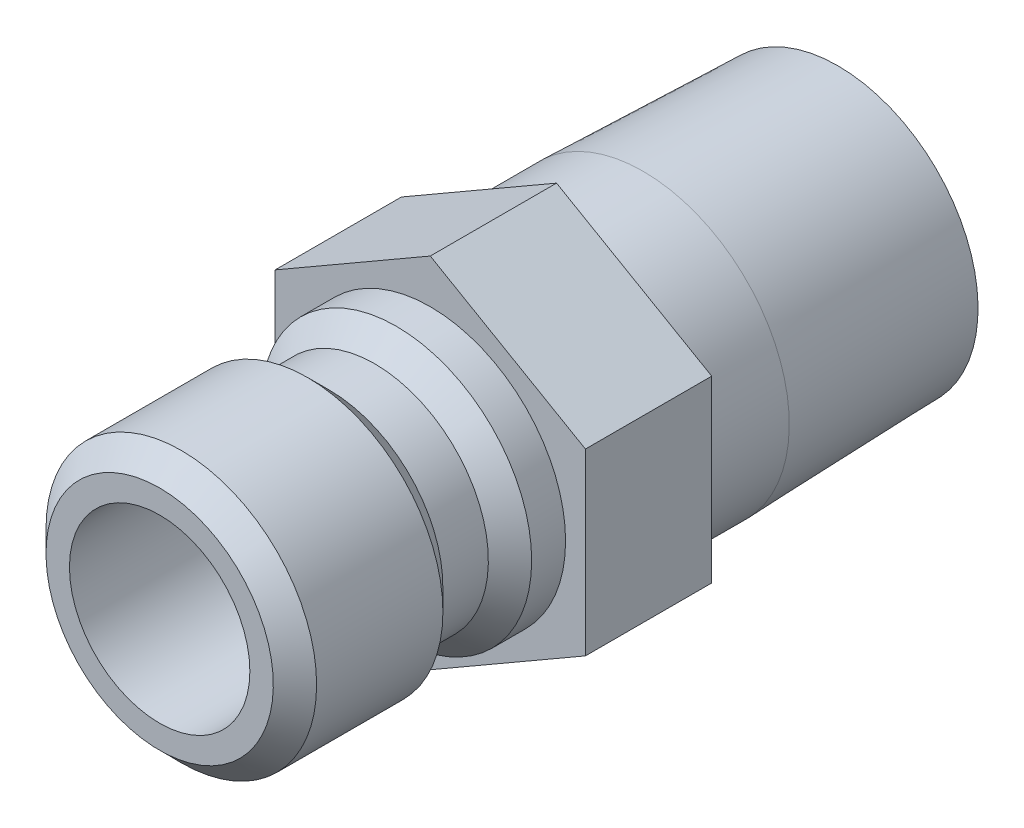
ISO-10303-21;
HEADER;
FILE_DESCRIPTION(('STEP AP214'),'2;1');
FILE_NAME('part.step','',(''),(''),'','','');
FILE_SCHEMA(('AUTOMOTIVE_DESIGN { 1 0 10303 214 1 1 1 1 }'));
ENDSEC;
DATA;
#1=APPLICATION_CONTEXT('core data for automotive mechanical design processes');
#2=APPLICATION_PROTOCOL_DEFINITION('international standard','automotive_design',2000,#1);
#3=PRODUCT_CONTEXT('',#1,'mechanical');
#4=PRODUCT('Part','Part','',(#3));
#5=PRODUCT_RELATED_PRODUCT_CATEGORY('part','',(#4));
#6=PRODUCT_DEFINITION_FORMATION('','',#4);
#7=PRODUCT_DEFINITION_CONTEXT('part definition',#1,'design');
#8=PRODUCT_DEFINITION('design','',#6,#7);
#9=PRODUCT_DEFINITION_SHAPE('','',#8);
#10=(LENGTH_UNIT() NAMED_UNIT(*) SI_UNIT(.MILLI.,.METRE.));
#11=(NAMED_UNIT(*) PLANE_ANGLE_UNIT() SI_UNIT($,.RADIAN.));
#12=(NAMED_UNIT(*) SI_UNIT($,.STERADIAN.) SOLID_ANGLE_UNIT());
#13=UNCERTAINTY_MEASURE_WITH_UNIT(LENGTH_MEASURE(1.E-05),#10,'distance_accuracy_value','');
#14=(GEOMETRIC_REPRESENTATION_CONTEXT(3) GLOBAL_UNCERTAINTY_ASSIGNED_CONTEXT((#13)) GLOBAL_UNIT_ASSIGNED_CONTEXT((#10,
#11,#12)) REPRESENTATION_CONTEXT('',''));
#15=CARTESIAN_POINT('',(0.,0.,0.));
#16=DIRECTION('',(0.,0.,1.));
#17=DIRECTION('',(1.,0.,0.));
#18=AXIS2_PLACEMENT_3D('',#15,#16,#17);
#19=CARTESIAN_POINT('',(0.,0.,0.));
#20=DIRECTION('',(0.,0.,-1.));
#21=DIRECTION('',(0.,1.,0.));
#22=AXIS2_PLACEMENT_3D('',#19,#20,#21);
#23=CYLINDRICAL_SURFACE('',#22,5.1435);
#24=CARTESIAN_POINT('',(0.,0.,-7.493));
#25=DIRECTION('',(0.,0.,-1.));
#26=DIRECTION('',(0.,1.,0.));
#27=AXIS2_PLACEMENT_3D('',#24,#25,#26);
#28=CIRCLE('',#27,5.1435);
#29=CARTESIAN_POINT('',(0.,5.1435,-7.493));
#30=VERTEX_POINT('',#29);
#31=EDGE_CURVE('E156',#30,#30,#28,.T.);
#32=ORIENTED_EDGE('',*,*,#31,.F.);
#33=EDGE_LOOP('',(#32));
#34=FACE_BOUND('',#33,.T.);
#35=CARTESIAN_POINT('',(0.,0.,-4.445));
#36=DIRECTION('',(0.,0.,1.));
#37=DIRECTION('',(1.,0.,0.));
#38=AXIS2_PLACEMENT_3D('',#35,#36,#37);
#39=CIRCLE('',#38,5.1435);
#40=CARTESIAN_POINT('',(5.1435,0.,-4.445));
#41=VERTEX_POINT('',#40);
#42=EDGE_CURVE('E37',#41,#41,#39,.F.);
#43=ORIENTED_EDGE('',*,*,#42,.T.);
#44=EDGE_LOOP('',(#43));
#45=FACE_BOUND('',#44,.T.);
#46=ADVANCED_FACE('F33',(#34,#45),#23,.T.);
#47=CARTESIAN_POINT('',(0.,0.,0.));
#48=DIRECTION('',(0.,0.,-1.));
#49=DIRECTION('',(0.,1.,0.));
#50=AXIS2_PLACEMENT_3D('',#47,#48,#49);
#51=CYLINDRICAL_SURFACE('',#50,3.175);
#52=CARTESIAN_POINT('',(0.,0.,9.525));
#53=DIRECTION('',(0.,0.,-1.));
#54=DIRECTION('',(0.,1.,0.));
#55=AXIS2_PLACEMENT_3D('',#52,#53,#54);
#56=CIRCLE('',#55,3.175);
#57=CARTESIAN_POINT('',(0.,3.175,9.525));
#58=VERTEX_POINT('',#57);
#59=EDGE_CURVE('E11',#58,#58,#56,.T.);
#60=ORIENTED_EDGE('',*,*,#59,.F.);
#61=EDGE_LOOP('',(#60));
#62=FACE_BOUND('',#61,.T.);
#63=CARTESIAN_POINT('',(0.,0.,-0.126999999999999));
#64=DIRECTION('',(0.,0.,-1.));
#65=DIRECTION('',(0.,1.,0.));
#66=AXIS2_PLACEMENT_3D('',#63,#64,#65);
#67=CIRCLE('',#66,3.175);
#68=CARTESIAN_POINT('',(0.,3.175,-0.126999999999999));
#69=VERTEX_POINT('',#68);
#70=EDGE_CURVE('E144',#69,#69,#67,.T.);
#71=ORIENTED_EDGE('',*,*,#70,.T.);
#72=EDGE_LOOP('',(#71));
#73=FACE_BOUND('',#72,.T.);
#74=ADVANCED_FACE('F35',(#62,#73),#51,.F.);
#75=CARTESIAN_POINT('',(0.,3.175,9.525));
#76=DIRECTION('',(0.,0.,1.));
#77=DIRECTION('',(0.,-1.,0.));
#78=AXIS2_PLACEMENT_3D('',#75,#76,#77);
#79=PLANE('',#78);
#80=ORIENTED_EDGE('',*,*,#59,.T.);
#81=EDGE_LOOP('',(#80));
#82=FACE_BOUND('',#81,.T.);
#83=CARTESIAN_POINT('',(0.,0.,9.525));
#84=DIRECTION('',(0.,0.,-1.));
#85=DIRECTION('',(0.,1.,0.));
#86=AXIS2_PLACEMENT_3D('',#83,#84,#85);
#87=CIRCLE('',#86,4.0005);
#88=CARTESIAN_POINT('',(0.,4.0005,9.525));
#89=VERTEX_POINT('',#88);
#90=EDGE_CURVE('E43',#89,#89,#87,.T.);
#91=ORIENTED_EDGE('',*,*,#90,.F.);
#92=EDGE_LOOP('',(#91));
#93=FACE_BOUND('',#92,.T.);
#94=ADVANCED_FACE('F183',(#82,#93),#79,.T.);
#95=CARTESIAN_POINT('',(0.,0.,8.763));
#96=DIRECTION('',(0.,0.,-1.));
#97=DIRECTION('',(0.,1.,0.));
#98=AXIS2_PLACEMENT_3D('',#95,#96,#97);
#99=CONICAL_SURFACE('',#98,4.7625,0.785398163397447);
#100=ORIENTED_EDGE('',*,*,#90,.T.);
#101=EDGE_LOOP('',(#100));
#102=FACE_BOUND('',#101,.T.);
#103=CARTESIAN_POINT('',(0.,0.,8.763));
#104=DIRECTION('',(0.,0.,-1.));
#105=DIRECTION('',(0.,1.,0.));
#106=AXIS2_PLACEMENT_3D('',#103,#104,#105);
#107=CIRCLE('',#106,4.7625);
#108=CARTESIAN_POINT('',(0.,4.7625,8.763));
#109=VERTEX_POINT('',#108);
#110=EDGE_CURVE('E174',#109,#109,#107,.T.);
#111=ORIENTED_EDGE('',*,*,#110,.F.);
#112=EDGE_LOOP('',(#111));
#113=FACE_BOUND('',#112,.T.);
#114=ADVANCED_FACE('F180',(#102,#113),#99,.T.);
#115=CARTESIAN_POINT('',(0.,0.,0.));
#116=DIRECTION('',(0.,0.,-1.));
#117=DIRECTION('',(0.,1.,0.));
#118=AXIS2_PLACEMENT_3D('',#115,#116,#117);
#119=CYLINDRICAL_SURFACE('',#118,4.7625);
#120=ORIENTED_EDGE('',*,*,#110,.T.);
#121=EDGE_LOOP('',(#120));
#122=FACE_BOUND('',#121,.T.);
#123=CARTESIAN_POINT('',(0.,0.,4.318));
#124=DIRECTION('',(0.,0.,-1.));
#125=DIRECTION('',(0.,1.,0.));
#126=AXIS2_PLACEMENT_3D('',#123,#124,#125);
#127=CIRCLE('',#126,4.7625);
#128=CARTESIAN_POINT('',(0.,4.7625,4.318));
#129=VERTEX_POINT('',#128);
#130=EDGE_CURVE('E171',#129,#129,#127,.T.);
#131=ORIENTED_EDGE('',*,*,#130,.F.);
#132=EDGE_LOOP('',(#131));
#133=FACE_BOUND('',#132,.T.);
#134=ADVANCED_FACE('F190',(#122,#133),#119,.T.);
#135=CARTESIAN_POINT('',(0.,0.,3.556));
#136=DIRECTION('',(0.,0.,1.));
#137=DIRECTION('',(0.,-1.,0.));
#138=AXIS2_PLACEMENT_3D('',#135,#136,#137);
#139=CONICAL_SURFACE('',#138,4.0005,0.785398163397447);
#140=ORIENTED_EDGE('',*,*,#130,.T.);
#141=EDGE_LOOP('',(#140));
#142=FACE_BOUND('',#141,.T.);
#143=CARTESIAN_POINT('',(0.,0.,3.556));
#144=DIRECTION('',(0.,0.,-1.));
#145=DIRECTION('',(0.,1.,0.));
#146=AXIS2_PLACEMENT_3D('',#143,#144,#145);
#147=CIRCLE('',#146,4.0005);
#148=CARTESIAN_POINT('',(0.,4.0005,3.556));
#149=VERTEX_POINT('',#148);
#150=EDGE_CURVE('E168',#149,#149,#147,.T.);
#151=ORIENTED_EDGE('',*,*,#150,.F.);
#152=EDGE_LOOP('',(#151));
#153=FACE_BOUND('',#152,.T.);
#154=ADVANCED_FACE('F219',(#142,#153),#139,.T.);
#155=CARTESIAN_POINT('',(0.,0.,0.));
#156=DIRECTION('',(0.,0.,-1.));
#157=DIRECTION('',(0.,1.,0.));
#158=AXIS2_PLACEMENT_3D('',#155,#156,#157);
#159=CYLINDRICAL_SURFACE('',#158,4.0005);
#160=ORIENTED_EDGE('',*,*,#150,.T.);
#161=EDGE_LOOP('',(#160));
#162=FACE_BOUND('',#161,.T.);
#163=CARTESIAN_POINT('',(0.,0.,1.9558));
#164=DIRECTION('',(0.,0.,-1.));
#165=DIRECTION('',(0.,1.,0.));
#166=AXIS2_PLACEMENT_3D('',#163,#164,#165);
#167=CIRCLE('',#166,4.0005);
#168=CARTESIAN_POINT('',(0.,4.0005,1.9558));
#169=VERTEX_POINT('',#168);
#170=EDGE_CURVE('E165',#169,#169,#167,.T.);
#171=ORIENTED_EDGE('',*,*,#170,.F.);
#172=EDGE_LOOP('',(#171));
#173=FACE_BOUND('',#172,.T.);
#174=ADVANCED_FACE('F215',(#162,#173),#159,.T.);
#175=CARTESIAN_POINT('',(0.,0.,1.1938));
#176=DIRECTION('',(0.,0.,-1.));
#177=DIRECTION('',(0.,1.,0.));
#178=AXIS2_PLACEMENT_3D('',#175,#176,#177);
#179=CONICAL_SURFACE('',#178,4.7625,0.785398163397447);
#180=ORIENTED_EDGE('',*,*,#170,.T.);
#181=EDGE_LOOP('',(#180));
#182=FACE_BOUND('',#181,.T.);
#183=CARTESIAN_POINT('',(0.,0.,1.1938));
#184=DIRECTION('',(0.,0.,-1.));
#185=DIRECTION('',(0.,1.,0.));
#186=AXIS2_PLACEMENT_3D('',#183,#184,#185);
#187=CIRCLE('',#186,4.7625);
#188=CARTESIAN_POINT('',(0.,4.7625,1.1938));
#189=VERTEX_POINT('',#188);
#190=EDGE_CURVE('E162',#189,#189,#187,.T.);
#191=ORIENTED_EDGE('',*,*,#190,.F.);
#192=EDGE_LOOP('',(#191));
#193=FACE_BOUND('',#192,.T.);
#194=ADVANCED_FACE('F211',(#182,#193),#179,.T.);
#195=CARTESIAN_POINT('',(0.,0.,0.));
#196=DIRECTION('',(0.,0.,-1.));
#197=DIRECTION('',(0.,1.,0.));
#198=AXIS2_PLACEMENT_3D('',#195,#196,#197);
#199=CYLINDRICAL_SURFACE('',#198,4.7625);
#200=ORIENTED_EDGE('',*,*,#190,.T.);
#201=EDGE_LOOP('',(#200));
#202=FACE_BOUND('',#201,.T.);
#203=CARTESIAN_POINT('',(0.,0.,0.));
#204=DIRECTION('',(0.,0.,-1.));
#205=DIRECTION('',(0.,1.,0.));
#206=AXIS2_PLACEMENT_3D('',#203,#204,#205);
#207=CIRCLE('',#206,4.7625);
#208=CARTESIAN_POINT('',(0.,4.7625,0.));
#209=VERTEX_POINT('',#208);
#210=EDGE_CURVE('E159',#209,#209,#207,.T.);
#211=ORIENTED_EDGE('',*,*,#210,.F.);
#212=EDGE_LOOP('',(#211));
#213=FACE_BOUND('',#212,.T.);
#214=ADVANCED_FACE('F207',(#202,#213),#199,.T.);
#215=CARTESIAN_POINT('',(0.,4.7625,0.));
#216=DIRECTION('',(0.,0.,1.));
#217=DIRECTION('',(0.,-1.,0.));
#218=AXIS2_PLACEMENT_3D('',#215,#216,#217);
#219=PLANE('',#218);
#220=ORIENTED_EDGE('',*,*,#210,.T.);
#221=EDGE_LOOP('',(#220));
#222=FACE_BOUND('',#221,.T.);
#223=DIRECTION('',(-0.866025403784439,-0.5,0.));
#224=VECTOR('',#223,1.);
#225=CARTESIAN_POINT('',(0.,6.30581964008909,0.));
#226=LINE('',#225,#224);
#227=CARTESIAN_POINT('',(0.,6.30581964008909,0.));
#228=VERTEX_POINT('',#227);
#229=CARTESIAN_POINT('',(-5.461,3.15290982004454,0.));
#230=VERTEX_POINT('',#229);
#231=EDGE_CURVE('E122',#228,#230,#226,.T.);
#232=ORIENTED_EDGE('',*,*,#231,.T.);
#233=DIRECTION('',(0.,-1.,0.));
#234=VECTOR('',#233,1.);
#235=CARTESIAN_POINT('',(-5.461,3.15290982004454,0.));
#236=LINE('',#235,#234);
#237=CARTESIAN_POINT('',(-5.461,-3.15290982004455,0.));
#238=VERTEX_POINT('',#237);
#239=EDGE_CURVE('E125',#230,#238,#236,.T.);
#240=ORIENTED_EDGE('',*,*,#239,.T.);
#241=DIRECTION('',(0.866025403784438,-0.5,0.));
#242=VECTOR('',#241,1.);
#243=CARTESIAN_POINT('',(-5.461,-3.15290982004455,0.));
#244=LINE('',#243,#242);
#245=CARTESIAN_POINT('',(0.,-6.30581964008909,0.));
#246=VERTEX_POINT('',#245);
#247=EDGE_CURVE('E128',#238,#246,#244,.T.);
#248=ORIENTED_EDGE('',*,*,#247,.T.);
#249=DIRECTION('',(0.866025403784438,0.5,0.));
#250=VECTOR('',#249,1.);
#251=CARTESIAN_POINT('',(0.,-6.30581964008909,0.));
#252=LINE('',#251,#250);
#253=CARTESIAN_POINT('',(5.461,-3.15290982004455,0.));
#254=VERTEX_POINT('',#253);
#255=EDGE_CURVE('E131',#246,#254,#252,.T.);
#256=ORIENTED_EDGE('',*,*,#255,.T.);
#257=DIRECTION('',(0.,1.,0.));
#258=VECTOR('',#257,1.);
#259=CARTESIAN_POINT('',(5.461,-3.15290982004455,0.));
#260=LINE('',#259,#258);
#261=CARTESIAN_POINT('',(5.461,3.15290982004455,0.));
#262=VERTEX_POINT('',#261);
#263=EDGE_CURVE('E99',#254,#262,#260,.T.);
#264=ORIENTED_EDGE('',*,*,#263,.T.);
#265=DIRECTION('',(-0.866025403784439,0.5,0.));
#266=VECTOR('',#265,1.);
#267=CARTESIAN_POINT('',(5.461,3.15290982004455,0.));
#268=LINE('',#267,#266);
#269=EDGE_CURVE('E134',#262,#228,#268,.T.);
#270=ORIENTED_EDGE('',*,*,#269,.T.);
#271=EDGE_LOOP('',(#232,#240,#248,#256,#264,#270));
#272=FACE_BOUND('',#271,.T.);
#273=ADVANCED_FACE('F204',(#222,#272),#219,.T.);
#274=CARTESIAN_POINT('',(0.,0.,-14.351));
#275=DIRECTION('',(0.,0.,1.));
#276=DIRECTION('',(0.,-1.,0.));
#277=AXIS2_PLACEMENT_3D('',#274,#275,#276);
#278=CONICAL_SURFACE('',#277,4.9291887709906,0.0312396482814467);
#279=ORIENTED_EDGE('',*,*,#31,.T.);
#280=EDGE_LOOP('',(#279));
#281=FACE_BOUND('',#280,.T.);
#282=CARTESIAN_POINT('',(0.,0.,-14.351));
#283=DIRECTION('',(0.,0.,-1.));
#284=DIRECTION('',(0.,1.,0.));
#285=AXIS2_PLACEMENT_3D('',#282,#283,#284);
#286=CIRCLE('',#285,4.9291887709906);
#287=CARTESIAN_POINT('',(0.,4.9291887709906,-14.351));
#288=VERTEX_POINT('',#287);
#289=EDGE_CURVE('E153',#288,#288,#286,.T.);
#290=ORIENTED_EDGE('',*,*,#289,.F.);
#291=EDGE_LOOP('',(#290));
#292=FACE_BOUND('',#291,.T.);
#293=ADVANCED_FACE('F202',(#281,#292),#278,.T.);
#294=CARTESIAN_POINT('',(0.,4.9291887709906,-14.351));
#295=DIRECTION('',(0.,0.,-1.));
#296=DIRECTION('',(0.,1.,0.));
#297=AXIS2_PLACEMENT_3D('',#294,#295,#296);
#298=PLANE('',#297);
#299=ORIENTED_EDGE('',*,*,#289,.T.);
#300=EDGE_LOOP('',(#299));
#301=FACE_BOUND('',#300,.T.);
#302=CARTESIAN_POINT('',(0.,0.,-14.351));
#303=DIRECTION('',(0.,0.,-1.));
#304=DIRECTION('',(0.,1.,0.));
#305=AXIS2_PLACEMENT_3D('',#302,#303,#304);
#306=CIRCLE('',#305,2.9464);
#307=CARTESIAN_POINT('',(0.,2.9464,-14.351));
#308=VERTEX_POINT('',#307);
#309=EDGE_CURVE('E150',#308,#308,#306,.T.);
#310=ORIENTED_EDGE('',*,*,#309,.F.);
#311=EDGE_LOOP('',(#310));
#312=FACE_BOUND('',#311,.T.);
#313=ADVANCED_FACE('F268',(#301,#312),#298,.T.);
#314=CARTESIAN_POINT('',(0.,0.,0.));
#315=DIRECTION('',(0.,0.,-1.));
#316=DIRECTION('',(0.,1.,0.));
#317=AXIS2_PLACEMENT_3D('',#314,#315,#316);
#318=CYLINDRICAL_SURFACE('',#317,2.9464);
#319=ORIENTED_EDGE('',*,*,#309,.T.);
#320=EDGE_LOOP('',(#319));
#321=FACE_BOUND('',#320,.T.);
#322=CARTESIAN_POINT('',(0.,0.,-0.126999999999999));
#323=DIRECTION('',(0.,0.,-1.));
#324=DIRECTION('',(0.,1.,0.));
#325=AXIS2_PLACEMENT_3D('',#322,#323,#324);
#326=CIRCLE('',#325,2.9464);
#327=CARTESIAN_POINT('',(0.,2.9464,-0.126999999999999));
#328=VERTEX_POINT('',#327);
#329=EDGE_CURVE('E147',#328,#328,#326,.T.);
#330=ORIENTED_EDGE('',*,*,#329,.F.);
#331=EDGE_LOOP('',(#330));
#332=FACE_BOUND('',#331,.T.);
#333=ADVANCED_FACE('F265',(#321,#332),#318,.F.);
#334=CARTESIAN_POINT('',(0.,3.175,-0.126999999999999));
#335=DIRECTION('',(0.,0.,1.));
#336=DIRECTION('',(0.,-1.,0.));
#337=AXIS2_PLACEMENT_3D('',#334,#335,#336);
#338=PLANE('',#337);
#339=ORIENTED_EDGE('',*,*,#329,.T.);
#340=EDGE_LOOP('',(#339));
#341=FACE_BOUND('',#340,.T.);
#342=ORIENTED_EDGE('',*,*,#70,.F.);
#343=EDGE_LOOP('',(#342));
#344=FACE_BOUND('',#343,.T.);
#345=ADVANCED_FACE('F253',(#341,#344),#338,.T.);
#346=CARTESIAN_POINT('',(0.,6.30581964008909,-4.445));
#347=DIRECTION('',(-0.5,0.866025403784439,0.));
#348=DIRECTION('',(-0.866025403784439,-0.5,0.));
#349=AXIS2_PLACEMENT_3D('',#346,#347,#348);
#350=PLANE('',#349);
#351=ORIENTED_EDGE('',*,*,#231,.F.);
#352=DIRECTION('',(0.,0.,1.));
#353=VECTOR('',#352,1.);
#354=CARTESIAN_POINT('',(0.,6.30581964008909,-4.445));
#355=LINE('',#354,#353);
#356=CARTESIAN_POINT('',(0.,6.30581964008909,-4.445));
#357=VERTEX_POINT('',#356);
#358=EDGE_CURVE('E51',#357,#228,#355,.T.);
#359=ORIENTED_EDGE('',*,*,#358,.F.);
#360=DIRECTION('',(-0.866025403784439,-0.5,0.));
#361=VECTOR('',#360,1.);
#362=CARTESIAN_POINT('',(0.,6.30581964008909,-4.445));
#363=LINE('',#362,#361);
#364=CARTESIAN_POINT('',(-5.461,3.15290982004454,-4.445));
#365=VERTEX_POINT('',#364);
#366=EDGE_CURVE('E137',#357,#365,#363,.T.);
#367=ORIENTED_EDGE('',*,*,#366,.T.);
#368=DIRECTION('',(0.,0.,1.));
#369=VECTOR('',#368,1.);
#370=CARTESIAN_POINT('',(-5.461,3.15290982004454,-4.445));
#371=LINE('',#370,#369);
#372=EDGE_CURVE('E86',#365,#230,#371,.T.);
#373=ORIENTED_EDGE('',*,*,#372,.T.);
#374=EDGE_LOOP('',(#351,#359,#367,#373));
#375=FACE_BOUND('',#374,.T.);
#376=ADVANCED_FACE('F240',(#375),#350,.T.);
#377=CARTESIAN_POINT('',(5.461,3.15290982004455,-4.445));
#378=DIRECTION('',(0.5,0.866025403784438,0.));
#379=DIRECTION('',(-0.866025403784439,0.5,0.));
#380=AXIS2_PLACEMENT_3D('',#377,#378,#379);
#381=PLANE('',#380);
#382=ORIENTED_EDGE('',*,*,#269,.F.);
#383=DIRECTION('',(0.,0.,1.));
#384=VECTOR('',#383,1.);
#385=CARTESIAN_POINT('',(5.461,3.15290982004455,-4.445));
#386=LINE('',#385,#384);
#387=CARTESIAN_POINT('',(5.461,3.15290982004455,-4.445));
#388=VERTEX_POINT('',#387);
#389=EDGE_CURVE('E74',#388,#262,#386,.T.);
#390=ORIENTED_EDGE('',*,*,#389,.F.);
#391=DIRECTION('',(-0.866025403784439,0.5,0.));
#392=VECTOR('',#391,1.);
#393=CARTESIAN_POINT('',(5.461,3.15290982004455,-4.445));
#394=LINE('',#393,#392);
#395=EDGE_CURVE('E112',#388,#357,#394,.T.);
#396=ORIENTED_EDGE('',*,*,#395,.T.);
#397=ORIENTED_EDGE('',*,*,#358,.T.);
#398=EDGE_LOOP('',(#382,#390,#396,#397));
#399=FACE_BOUND('',#398,.T.);
#400=ADVANCED_FACE('F245',(#399),#381,.T.);
#401=CARTESIAN_POINT('',(5.461,-3.15290982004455,-4.445));
#402=DIRECTION('',(1.,0.,0.));
#403=DIRECTION('',(0.,0.,-1.));
#404=AXIS2_PLACEMENT_3D('',#401,#402,#403);
#405=PLANE('',#404);
#406=ORIENTED_EDGE('',*,*,#263,.F.);
#407=DIRECTION('',(0.,0.,1.));
#408=VECTOR('',#407,1.);
#409=CARTESIAN_POINT('',(5.461,-3.15290982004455,-4.445));
#410=LINE('',#409,#408);
#411=CARTESIAN_POINT('',(5.461,-3.15290982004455,-4.445));
#412=VERTEX_POINT('',#411);
#413=EDGE_CURVE('E94',#412,#254,#410,.T.);
#414=ORIENTED_EDGE('',*,*,#413,.F.);
#415=DIRECTION('',(0.,1.,0.));
#416=VECTOR('',#415,1.);
#417=CARTESIAN_POINT('',(5.461,-3.15290982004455,-4.445));
#418=LINE('',#417,#416);
#419=EDGE_CURVE('E97',#412,#388,#418,.T.);
#420=ORIENTED_EDGE('',*,*,#419,.T.);
#421=ORIENTED_EDGE('',*,*,#389,.T.);
#422=EDGE_LOOP('',(#406,#414,#420,#421));
#423=FACE_BOUND('',#422,.T.);
#424=ADVANCED_FACE('F96',(#423),#405,.T.);
#425=CARTESIAN_POINT('',(0.,-6.30581964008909,-4.445));
#426=DIRECTION('',(0.5,-0.866025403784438,0.));
#427=DIRECTION('',(0.866025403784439,0.5,0.));
#428=AXIS2_PLACEMENT_3D('',#425,#426,#427);
#429=PLANE('',#428);
#430=ORIENTED_EDGE('',*,*,#255,.F.);
#431=DIRECTION('',(0.,0.,1.));
#432=VECTOR('',#431,1.);
#433=CARTESIAN_POINT('',(0.,-6.30581964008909,-4.445));
#434=LINE('',#433,#432);
#435=CARTESIAN_POINT('',(0.,-6.30581964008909,-4.445));
#436=VERTEX_POINT('',#435);
#437=EDGE_CURVE('E104',#436,#246,#434,.T.);
#438=ORIENTED_EDGE('',*,*,#437,.F.);
#439=DIRECTION('',(0.866025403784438,0.5,0.));
#440=VECTOR('',#439,1.);
#441=CARTESIAN_POINT('',(0.,-6.30581964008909,-4.445));
#442=LINE('',#441,#440);
#443=EDGE_CURVE('E110',#436,#412,#442,.T.);
#444=ORIENTED_EDGE('',*,*,#443,.T.);
#445=ORIENTED_EDGE('',*,*,#413,.T.);
#446=EDGE_LOOP('',(#430,#438,#444,#445));
#447=FACE_BOUND('',#446,.T.);
#448=ADVANCED_FACE('F114',(#447),#429,.T.);
#449=CARTESIAN_POINT('',(-5.461,-3.15290982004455,-4.445));
#450=DIRECTION('',(-0.5,-0.866025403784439,0.));
#451=DIRECTION('',(0.866025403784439,-0.5,0.));
#452=AXIS2_PLACEMENT_3D('',#449,#450,#451);
#453=PLANE('',#452);
#454=ORIENTED_EDGE('',*,*,#247,.F.);
#455=DIRECTION('',(0.,0.,1.));
#456=VECTOR('',#455,1.);
#457=CARTESIAN_POINT('',(-5.461,-3.15290982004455,-4.445));
#458=LINE('',#457,#456);
#459=CARTESIAN_POINT('',(-5.461,-3.15290982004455,-4.445));
#460=VERTEX_POINT('',#459);
#461=EDGE_CURVE('E141',#460,#238,#458,.T.);
#462=ORIENTED_EDGE('',*,*,#461,.F.);
#463=DIRECTION('',(0.866025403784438,-0.5,0.));
#464=VECTOR('',#463,1.);
#465=CARTESIAN_POINT('',(-5.461,-3.15290982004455,-4.445));
#466=LINE('',#465,#464);
#467=EDGE_CURVE('E115',#460,#436,#466,.T.);
#468=ORIENTED_EDGE('',*,*,#467,.T.);
#469=ORIENTED_EDGE('',*,*,#437,.T.);
#470=EDGE_LOOP('',(#454,#462,#468,#469));
#471=FACE_BOUND('',#470,.T.);
#472=ADVANCED_FACE('F244',(#471),#453,.T.);
#473=CARTESIAN_POINT('',(-5.461,3.15290982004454,-4.445));
#474=DIRECTION('',(-1.,0.,0.));
#475=DIRECTION('',(0.,0.,1.));
#476=AXIS2_PLACEMENT_3D('',#473,#474,#475);
#477=PLANE('',#476);
#478=ORIENTED_EDGE('',*,*,#239,.F.);
#479=ORIENTED_EDGE('',*,*,#372,.F.);
#480=DIRECTION('',(0.,-1.,0.));
#481=VECTOR('',#480,1.);
#482=CARTESIAN_POINT('',(-5.461,3.15290982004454,-4.445));
#483=LINE('',#482,#481);
#484=EDGE_CURVE('E117',#365,#460,#483,.T.);
#485=ORIENTED_EDGE('',*,*,#484,.T.);
#486=ORIENTED_EDGE('',*,*,#461,.T.);
#487=EDGE_LOOP('',(#478,#479,#485,#486));
#488=FACE_BOUND('',#487,.T.);
#489=ADVANCED_FACE('F241',(#488),#477,.T.);
#490=CARTESIAN_POINT('',(-5.461,3.15290982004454,-4.445));
#491=DIRECTION('',(0.,0.,1.));
#492=DIRECTION('',(1.,0.,0.));
#493=AXIS2_PLACEMENT_3D('',#490,#491,#492);
#494=PLANE('',#493);
#495=ORIENTED_EDGE('',*,*,#42,.F.);
#496=EDGE_LOOP('',(#495));
#497=FACE_BOUND('',#496,.T.);
#498=ORIENTED_EDGE('',*,*,#366,.F.);
#499=ORIENTED_EDGE('',*,*,#395,.F.);
#500=ORIENTED_EDGE('',*,*,#419,.F.);
#501=ORIENTED_EDGE('',*,*,#443,.F.);
#502=ORIENTED_EDGE('',*,*,#467,.F.);
#503=ORIENTED_EDGE('',*,*,#484,.F.);
#504=EDGE_LOOP('',(#498,#499,#500,#501,#502,#503));
#505=FACE_BOUND('',#504,.T.);
#506=ADVANCED_FACE('F108',(#497,#505),#494,.F.);
#507=CLOSED_SHELL('',(#46,#74,#94,#114,#134,#154,#174,#194,#214,#273,#293,#313,#333,#345,#376,
#400,#424,#448,#472,#489,#506));
#508=MANIFOLD_SOLID_BREP('B2',#507);
#509=ADVANCED_BREP_SHAPE_REPRESENTATION('',(#18,#508),#14);
#510=SHAPE_DEFINITION_REPRESENTATION(#9,#509);
ENDSEC;
END-ISO-10303-21;
